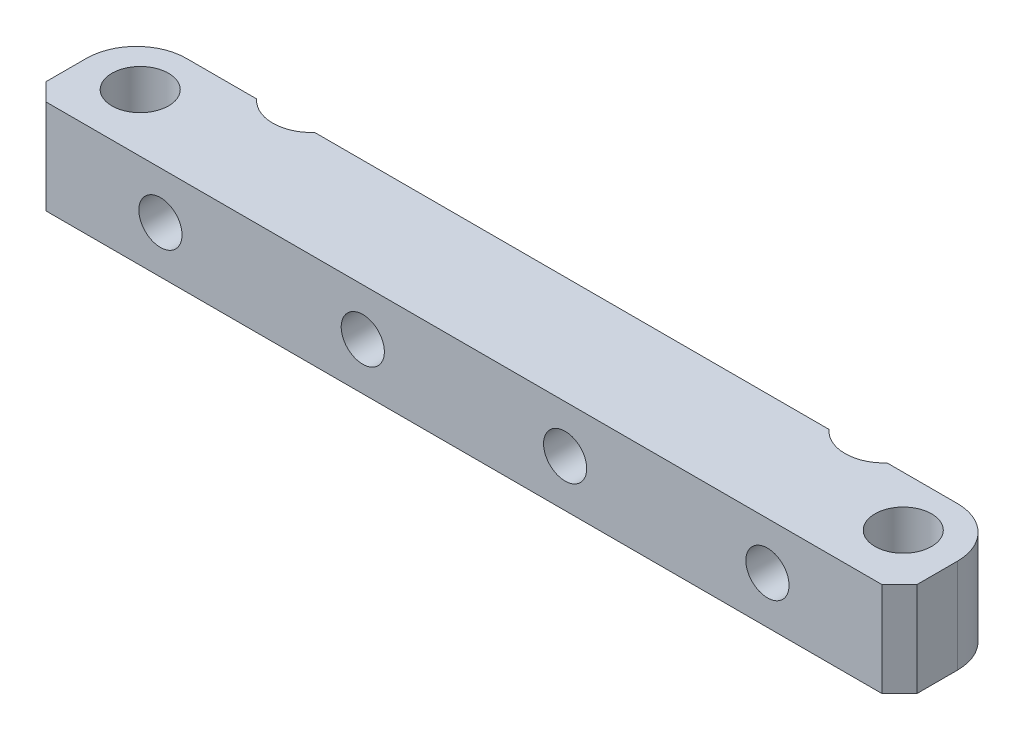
from build123d import *

# Parameters (mm, degrees)
SKETCH_1_W          = 64.568542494
SKETCH_1_H          = 8
SKETCH_1_R          = 2.1
EXTRUDE_1_DEPTH     = 7
FILLET_1_R          = 3.7
SKETCH_2_R          = 1.6
CUT_EXTRUDE_1_DEPTH = 34.989324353
CHAMFER_1_SIZE      = 1.3
SKETCH_4_R          = 2.9
CUT_EXTRUDE_2_DEPTH = 3.5
SKETCH_5_R          = 2.9
CUT_EXTRUDE_3_DEPTH = 46.992109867


with BuildPart() as part:
    # Sketch 1 → Extrude 1 (new body)
    with BuildSketch(Plane(origin=(0, 0, 0), x_dir=(1, 0, 0), z_dir=(0, 1, 0))):
        with Locations((0, 28)):
            Rectangle(SKETCH_1_W, SKETCH_1_H)
        with Locations(Location((-28.284271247, 28.284271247, 0), (0, 0, 270))):
            Circle(SKETCH_1_R, mode=Mode.SUBTRACT)
        with Locations(Location((28.284271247, 28.284271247, 0), (0, 0, 270))):
            Circle(SKETCH_1_R, mode=Mode.SUBTRACT)
    extrude(amount=EXTRUDE_1_DEPTH)

    # Fillet 1
    fillet_1_edges = [part.edges().sort_by_distance(p)[0] for p in [
        (-32.284271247, 3.5, -32),
        (32.284271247, 3.5, -32),
    ]]
    fillet(fillet_1_edges, radius=FILLET_1_R)

    # Sketch 2 → Cut-Extrude 1 (cut, through all)
    with BuildSketch(Plane.XY.offset(-24)):
        with Locations((-22.5, 3.5)):
            Circle(SKETCH_2_R)
        with Locations((-7.5, 3.5)):
            Circle(SKETCH_2_R)
        with Locations((7.5, 3.5)):
            Circle(SKETCH_2_R)
        with Locations((22.5, 3.5)):
            Circle(SKETCH_2_R)
    extrude(amount=-CUT_EXTRUDE_1_DEPTH, mode=Mode.SUBTRACT)

    # Chamfer 1
    chamfer_1_edges = [part.edges().sort_by_distance(p)[0] for p in [
        (32.284271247, 3.5, -24),
        (-32.284271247, 3.5, -24),
    ]]
    chamfer(chamfer_1_edges, length=CHAMFER_1_SIZE)

    # Sketch 4 → Cut-Extrude 2 (cut)
    with BuildSketch(Plane(origin=(0, 0, -32), x_dir=(-1, 0, 0), z_dir=(0, 0, -1))):
        with Locations((-22.5, 3.5)):
            Circle(SKETCH_4_R)
        with Locations((22.5, 3.5)):
            Circle(SKETCH_4_R)
    extrude(amount=-CUT_EXTRUDE_2_DEPTH, mode=Mode.SUBTRACT)

    # Sketch 5 → Cut-Extrude 3 (cut, through all)
    with BuildSketch(Plane.XZ):
        with Locations((21.213203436, -33.941125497)):
            Circle(SKETCH_5_R)
        with Locations((-21.213203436, -33.941125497)):
            Circle(SKETCH_5_R)
    extrude(amount=-CUT_EXTRUDE_3_DEPTH, mode=Mode.SUBTRACT)


solid = part.part
